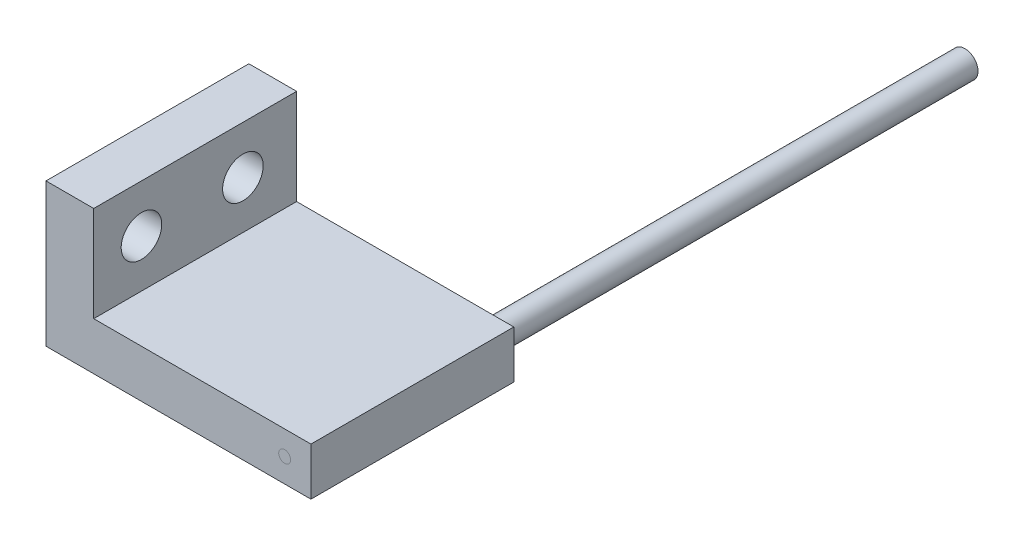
ISO-10303-21;
HEADER;
FILE_DESCRIPTION(('STEP AP214'),'2;1');
FILE_NAME('part.step','',(''),(''),'','','');
FILE_SCHEMA(('AUTOMOTIVE_DESIGN { 1 0 10303 214 1 1 1 1 }'));
ENDSEC;
DATA;
#1=APPLICATION_CONTEXT('core data for automotive mechanical design processes');
#2=APPLICATION_PROTOCOL_DEFINITION('international standard','automotive_design',2000,#1);
#3=PRODUCT_CONTEXT('',#1,'mechanical');
#4=PRODUCT('Part','Part','',(#3));
#5=PRODUCT_RELATED_PRODUCT_CATEGORY('part','',(#4));
#6=PRODUCT_DEFINITION_FORMATION('','',#4);
#7=PRODUCT_DEFINITION_CONTEXT('part definition',#1,'design');
#8=PRODUCT_DEFINITION('design','',#6,#7);
#9=PRODUCT_DEFINITION_SHAPE('','',#8);
#10=(LENGTH_UNIT() NAMED_UNIT(*) SI_UNIT(.MILLI.,.METRE.));
#11=(NAMED_UNIT(*) PLANE_ANGLE_UNIT() SI_UNIT($,.RADIAN.));
#12=(NAMED_UNIT(*) SI_UNIT($,.STERADIAN.) SOLID_ANGLE_UNIT());
#13=UNCERTAINTY_MEASURE_WITH_UNIT(LENGTH_MEASURE(1.E-05),#10,'distance_accuracy_value','');
#14=(GEOMETRIC_REPRESENTATION_CONTEXT(3) GLOBAL_UNCERTAINTY_ASSIGNED_CONTEXT((#13)) GLOBAL_UNIT_ASSIGNED_CONTEXT((#10,
#11,#12)) REPRESENTATION_CONTEXT('',''));
#15=CARTESIAN_POINT('',(0.,0.,0.));
#16=DIRECTION('',(0.,0.,1.));
#17=DIRECTION('',(1.,0.,0.));
#18=AXIS2_PLACEMENT_3D('',#15,#16,#17);
#19=CARTESIAN_POINT('',(0.,0.,17.));
#20=DIRECTION('',(0.,0.,-1.));
#21=DIRECTION('',(-1.,0.,0.));
#22=AXIS2_PLACEMENT_3D('',#19,#20,#21);
#23=PLANE('',#22);
#24=DIRECTION('',(1.,0.,0.));
#25=VECTOR('',#24,1.);
#26=CARTESIAN_POINT('',(22.2,0.,17.));
#27=LINE('',#26,#25);
#28=CARTESIAN_POINT('',(0.,0.,17.));
#29=VERTEX_POINT('',#28);
#30=CARTESIAN_POINT('',(22.2,0.,17.));
#31=VERTEX_POINT('',#30);
#32=EDGE_CURVE('E111',#29,#31,#27,.T.);
#33=ORIENTED_EDGE('',*,*,#32,.T.);
#34=DIRECTION('',(0.,1.,0.));
#35=VECTOR('',#34,1.);
#36=CARTESIAN_POINT('',(22.2,4.,17.));
#37=LINE('',#36,#35);
#38=CARTESIAN_POINT('',(22.2,4.,17.));
#39=VERTEX_POINT('',#38);
#40=EDGE_CURVE('E69',#31,#39,#37,.T.);
#41=ORIENTED_EDGE('',*,*,#40,.T.);
#42=DIRECTION('',(-1.,0.,0.));
#43=VECTOR('',#42,1.);
#44=CARTESIAN_POINT('',(4.,4.,17.));
#45=LINE('',#44,#43);
#46=CARTESIAN_POINT('',(4.,4.,17.));
#47=VERTEX_POINT('',#46);
#48=EDGE_CURVE('E82',#39,#47,#45,.T.);
#49=ORIENTED_EDGE('',*,*,#48,.T.);
#50=DIRECTION('',(0.,1.,0.));
#51=VECTOR('',#50,1.);
#52=CARTESIAN_POINT('',(4.,12.,17.));
#53=LINE('',#52,#51);
#54=CARTESIAN_POINT('',(4.,12.,17.));
#55=VERTEX_POINT('',#54);
#56=EDGE_CURVE('E76',#47,#55,#53,.T.);
#57=ORIENTED_EDGE('',*,*,#56,.T.);
#58=DIRECTION('',(-1.,0.,0.));
#59=VECTOR('',#58,1.);
#60=CARTESIAN_POINT('',(0.,12.,17.));
#61=LINE('',#60,#59);
#62=CARTESIAN_POINT('',(0.,12.,17.));
#63=VERTEX_POINT('',#62);
#64=EDGE_CURVE('E80',#55,#63,#61,.T.);
#65=ORIENTED_EDGE('',*,*,#64,.T.);
#66=DIRECTION('',(0.,-1.,0.));
#67=VECTOR('',#66,1.);
#68=CARTESIAN_POINT('',(0.,0.,17.));
#69=LINE('',#68,#67);
#70=EDGE_CURVE('E31',#63,#29,#69,.T.);
#71=ORIENTED_EDGE('',*,*,#70,.T.);
#72=EDGE_LOOP('',(#33,#41,#49,#57,#65,#71));
#73=FACE_BOUND('',#72,.T.);
#74=CARTESIAN_POINT('',(20.,2.,17.));
#75=DIRECTION('',(0.,0.,-1.));
#76=DIRECTION('',(-1.,0.,0.));
#77=AXIS2_PLACEMENT_3D('',#74,#75,#76);
#78=CIRCLE('',#77,0.5);
#79=CARTESIAN_POINT('',(19.5,2.,17.));
#80=VERTEX_POINT('',#79);
#81=EDGE_CURVE('E9',#80,#80,#78,.F.);
#82=ORIENTED_EDGE('',*,*,#81,.F.);
#83=EDGE_LOOP('',(#82));
#84=FACE_BOUND('',#83,.T.);
#85=ADVANCED_FACE('F14',(#73,#84),#23,.F.);
#86=CARTESIAN_POINT('',(20.,2.,-40.));
#87=DIRECTION('',(0.,0.,-1.));
#88=DIRECTION('',(-1.,0.,0.));
#89=AXIS2_PLACEMENT_3D('',#86,#87,#88);
#90=PLANE('',#89);
#91=CARTESIAN_POINT('',(20.,2.,-40.));
#92=DIRECTION('',(0.,0.,-1.));
#93=DIRECTION('',(-1.,0.,0.));
#94=AXIS2_PLACEMENT_3D('',#91,#92,#93);
#95=CIRCLE('',#94,1.1);
#96=CARTESIAN_POINT('',(18.9,2.,-40.));
#97=VERTEX_POINT('',#96);
#98=EDGE_CURVE('E194',#97,#97,#95,.T.);
#99=ORIENTED_EDGE('',*,*,#98,.T.);
#100=EDGE_LOOP('',(#99));
#101=FACE_BOUND('',#100,.T.);
#102=CARTESIAN_POINT('',(20.,2.,-40.));
#103=DIRECTION('',(0.,0.,-1.));
#104=DIRECTION('',(-1.,0.,0.));
#105=AXIS2_PLACEMENT_3D('',#102,#103,#104);
#106=CIRCLE('',#105,0.5);
#107=CARTESIAN_POINT('',(19.5,2.,-40.));
#108=VERTEX_POINT('',#107);
#109=EDGE_CURVE('E23',#108,#108,#106,.F.);
#110=ORIENTED_EDGE('',*,*,#109,.T.);
#111=EDGE_LOOP('',(#110));
#112=FACE_BOUND('',#111,.T.);
#113=ADVANCED_FACE('F122',(#101,#112),#90,.T.);
#114=CARTESIAN_POINT('',(22.2,0.,17.));
#115=DIRECTION('',(0.,1.,0.));
#116=DIRECTION('',(-1.,0.,0.));
#117=AXIS2_PLACEMENT_3D('',#114,#115,#116);
#118=PLANE('',#117);
#119=DIRECTION('',(1.,0.,0.));
#120=VECTOR('',#119,1.);
#121=CARTESIAN_POINT('',(22.2,0.,0.));
#122=LINE('',#121,#120);
#123=CARTESIAN_POINT('',(0.,0.,0.));
#124=VERTEX_POINT('',#123);
#125=CARTESIAN_POINT('',(22.2,0.,0.));
#126=VERTEX_POINT('',#125);
#127=EDGE_CURVE('E100',#124,#126,#122,.T.);
#128=ORIENTED_EDGE('',*,*,#127,.T.);
#129=DIRECTION('',(0.,0.,-1.));
#130=VECTOR('',#129,1.);
#131=CARTESIAN_POINT('',(22.2,0.,17.));
#132=LINE('',#131,#130);
#133=EDGE_CURVE('E118',#31,#126,#132,.T.);
#134=ORIENTED_EDGE('',*,*,#133,.F.);
#135=ORIENTED_EDGE('',*,*,#32,.F.);
#136=DIRECTION('',(0.,0.,-1.));
#137=VECTOR('',#136,1.);
#138=CARTESIAN_POINT('',(0.,0.,17.));
#139=LINE('',#138,#137);
#140=EDGE_CURVE('E96',#29,#124,#139,.T.);
#141=ORIENTED_EDGE('',*,*,#140,.T.);
#142=EDGE_LOOP('',(#128,#134,#135,#141));
#143=FACE_BOUND('',#142,.T.);
#144=ADVANCED_FACE('F16',(#143),#118,.F.);
#145=CARTESIAN_POINT('',(22.2,4.,17.));
#146=DIRECTION('',(-1.,0.,0.));
#147=DIRECTION('',(0.,0.,1.));
#148=AXIS2_PLACEMENT_3D('',#145,#146,#147);
#149=PLANE('',#148);
#150=DIRECTION('',(0.,1.,0.));
#151=VECTOR('',#150,1.);
#152=CARTESIAN_POINT('',(22.2,4.,0.));
#153=LINE('',#152,#151);
#154=CARTESIAN_POINT('',(22.2,4.,0.));
#155=VERTEX_POINT('',#154);
#156=EDGE_CURVE('E103',#126,#155,#153,.T.);
#157=ORIENTED_EDGE('',*,*,#156,.T.);
#158=DIRECTION('',(0.,0.,-1.));
#159=VECTOR('',#158,1.);
#160=CARTESIAN_POINT('',(22.2,4.,17.));
#161=LINE('',#160,#159);
#162=EDGE_CURVE('E115',#39,#155,#161,.T.);
#163=ORIENTED_EDGE('',*,*,#162,.F.);
#164=ORIENTED_EDGE('',*,*,#40,.F.);
#165=ORIENTED_EDGE('',*,*,#133,.T.);
#166=EDGE_LOOP('',(#157,#163,#164,#165));
#167=FACE_BOUND('',#166,.T.);
#168=ADVANCED_FACE('F172',(#167),#149,.F.);
#169=CARTESIAN_POINT('',(4.,4.,17.));
#170=DIRECTION('',(0.,-1.,0.));
#171=DIRECTION('',(1.,0.,0.));
#172=AXIS2_PLACEMENT_3D('',#169,#170,#171);
#173=PLANE('',#172);
#174=DIRECTION('',(-1.,0.,0.));
#175=VECTOR('',#174,1.);
#176=CARTESIAN_POINT('',(4.,4.,0.));
#177=LINE('',#176,#175);
#178=CARTESIAN_POINT('',(4.,4.,0.));
#179=VERTEX_POINT('',#178);
#180=EDGE_CURVE('E106',#155,#179,#177,.T.);
#181=ORIENTED_EDGE('',*,*,#180,.T.);
#182=DIRECTION('',(0.,0.,-1.));
#183=VECTOR('',#182,1.);
#184=CARTESIAN_POINT('',(4.,4.,17.));
#185=LINE('',#184,#183);
#186=EDGE_CURVE('E91',#47,#179,#185,.T.);
#187=ORIENTED_EDGE('',*,*,#186,.F.);
#188=ORIENTED_EDGE('',*,*,#48,.F.);
#189=ORIENTED_EDGE('',*,*,#162,.T.);
#190=EDGE_LOOP('',(#181,#187,#188,#189));
#191=FACE_BOUND('',#190,.T.);
#192=ADVANCED_FACE('F170',(#191),#173,.F.);
#193=CARTESIAN_POINT('',(4.,12.,17.));
#194=DIRECTION('',(-1.,0.,0.));
#195=DIRECTION('',(0.,-1.,0.));
#196=AXIS2_PLACEMENT_3D('',#193,#194,#195);
#197=PLANE('',#196);
#198=CARTESIAN_POINT('',(4.,8.,4.5));
#199=DIRECTION('',(1.,0.,0.));
#200=DIRECTION('',(0.,1.,0.));
#201=AXIS2_PLACEMENT_3D('',#198,#199,#200);
#202=CIRCLE('',#201,1.7);
#203=CARTESIAN_POINT('',(4.,9.7,4.5));
#204=VERTEX_POINT('',#203);
#205=EDGE_CURVE('E191',#204,#204,#202,.T.);
#206=ORIENTED_EDGE('',*,*,#205,.F.);
#207=EDGE_LOOP('',(#206));
#208=FACE_BOUND('',#207,.T.);
#209=CARTESIAN_POINT('',(4.,8.,13.));
#210=DIRECTION('',(1.,0.,0.));
#211=DIRECTION('',(0.,1.,0.));
#212=AXIS2_PLACEMENT_3D('',#209,#210,#211);
#213=CIRCLE('',#212,1.7);
#214=CARTESIAN_POINT('',(4.,9.7,13.));
#215=VERTEX_POINT('',#214);
#216=EDGE_CURVE('E185',#215,#215,#213,.T.);
#217=ORIENTED_EDGE('',*,*,#216,.F.);
#218=EDGE_LOOP('',(#217));
#219=FACE_BOUND('',#218,.T.);
#220=DIRECTION('',(0.,1.,0.));
#221=VECTOR('',#220,1.);
#222=CARTESIAN_POINT('',(4.,12.,0.));
#223=LINE('',#222,#221);
#224=CARTESIAN_POINT('',(4.,12.,0.));
#225=VERTEX_POINT('',#224);
#226=EDGE_CURVE('E90',#179,#225,#223,.T.);
#227=ORIENTED_EDGE('',*,*,#226,.T.);
#228=DIRECTION('',(0.,0.,-1.));
#229=VECTOR('',#228,1.);
#230=CARTESIAN_POINT('',(4.,12.,17.));
#231=LINE('',#230,#229);
#232=EDGE_CURVE('E87',#55,#225,#231,.T.);
#233=ORIENTED_EDGE('',*,*,#232,.F.);
#234=ORIENTED_EDGE('',*,*,#56,.F.);
#235=ORIENTED_EDGE('',*,*,#186,.T.);
#236=EDGE_LOOP('',(#227,#233,#234,#235));
#237=FACE_BOUND('',#236,.T.);
#238=ADVANCED_FACE('F88',(#208,#219,#237),#197,.F.);
#239=CARTESIAN_POINT('',(0.,12.,17.));
#240=DIRECTION('',(0.,-1.,0.));
#241=DIRECTION('',(0.,0.,-1.));
#242=AXIS2_PLACEMENT_3D('',#239,#240,#241);
#243=PLANE('',#242);
#244=DIRECTION('',(-1.,0.,0.));
#245=VECTOR('',#244,1.);
#246=CARTESIAN_POINT('',(0.,12.,0.));
#247=LINE('',#246,#245);
#248=CARTESIAN_POINT('',(0.,12.,0.));
#249=VERTEX_POINT('',#248);
#250=EDGE_CURVE('E54',#225,#249,#247,.T.);
#251=ORIENTED_EDGE('',*,*,#250,.T.);
#252=DIRECTION('',(0.,0.,-1.));
#253=VECTOR('',#252,1.);
#254=CARTESIAN_POINT('',(0.,12.,17.));
#255=LINE('',#254,#253);
#256=EDGE_CURVE('E92',#63,#249,#255,.T.);
#257=ORIENTED_EDGE('',*,*,#256,.F.);
#258=ORIENTED_EDGE('',*,*,#64,.F.);
#259=ORIENTED_EDGE('',*,*,#232,.T.);
#260=EDGE_LOOP('',(#251,#257,#258,#259));
#261=FACE_BOUND('',#260,.T.);
#262=ADVANCED_FACE('F94',(#261),#243,.F.);
#263=CARTESIAN_POINT('',(0.,0.,17.));
#264=DIRECTION('',(1.,0.,0.));
#265=DIRECTION('',(0.,0.,-1.));
#266=AXIS2_PLACEMENT_3D('',#263,#264,#265);
#267=PLANE('',#266);
#268=CARTESIAN_POINT('',(0.,8.,4.5));
#269=DIRECTION('',(1.,0.,0.));
#270=DIRECTION('',(0.,1.,0.));
#271=AXIS2_PLACEMENT_3D('',#268,#269,#270);
#272=CIRCLE('',#271,1.7);
#273=CARTESIAN_POINT('',(0.,9.7,4.5));
#274=VERTEX_POINT('',#273);
#275=EDGE_CURVE('E188',#274,#274,#272,.T.);
#276=ORIENTED_EDGE('',*,*,#275,.T.);
#277=EDGE_LOOP('',(#276));
#278=FACE_BOUND('',#277,.T.);
#279=CARTESIAN_POINT('',(0.,8.,13.));
#280=DIRECTION('',(1.,0.,0.));
#281=DIRECTION('',(0.,1.,0.));
#282=AXIS2_PLACEMENT_3D('',#279,#280,#281);
#283=CIRCLE('',#282,1.7);
#284=CARTESIAN_POINT('',(0.,9.7,13.));
#285=VERTEX_POINT('',#284);
#286=EDGE_CURVE('E104',#285,#285,#283,.T.);
#287=ORIENTED_EDGE('',*,*,#286,.T.);
#288=EDGE_LOOP('',(#287));
#289=FACE_BOUND('',#288,.T.);
#290=DIRECTION('',(0.,-1.,0.));
#291=VECTOR('',#290,1.);
#292=CARTESIAN_POINT('',(0.,0.,0.));
#293=LINE('',#292,#291);
#294=EDGE_CURVE('E60',#249,#124,#293,.T.);
#295=ORIENTED_EDGE('',*,*,#294,.T.);
#296=ORIENTED_EDGE('',*,*,#140,.F.);
#297=ORIENTED_EDGE('',*,*,#70,.F.);
#298=ORIENTED_EDGE('',*,*,#256,.T.);
#299=EDGE_LOOP('',(#295,#296,#297,#298));
#300=FACE_BOUND('',#299,.T.);
#301=ADVANCED_FACE('F148',(#278,#289,#300),#267,.F.);
#302=ORIENTED_EDGE('',*,*,#81,.T.);
#303=EDGE_LOOP('',(#302));
#304=FACE_BOUND('',#303,.T.);
#305=ADVANCED_FACE('F140',(#304),#23,.F.);
#306=CARTESIAN_POINT('',(0.,0.,0.));
#307=DIRECTION('',(0.,0.,-1.));
#308=DIRECTION('',(-1.,0.,0.));
#309=AXIS2_PLACEMENT_3D('',#306,#307,#308);
#310=PLANE('',#309);
#311=CARTESIAN_POINT('',(20.,2.,0.));
#312=DIRECTION('',(0.,0.,-1.));
#313=DIRECTION('',(-1.,0.,0.));
#314=AXIS2_PLACEMENT_3D('',#311,#312,#313);
#315=CIRCLE('',#314,1.1);
#316=CARTESIAN_POINT('',(18.9,2.,0.));
#317=VERTEX_POINT('',#316);
#318=EDGE_CURVE('E196',#317,#317,#315,.T.);
#319=ORIENTED_EDGE('',*,*,#318,.F.);
#320=EDGE_LOOP('',(#319));
#321=FACE_BOUND('',#320,.T.);
#322=ORIENTED_EDGE('',*,*,#127,.F.);
#323=ORIENTED_EDGE('',*,*,#294,.F.);
#324=ORIENTED_EDGE('',*,*,#250,.F.);
#325=ORIENTED_EDGE('',*,*,#226,.F.);
#326=ORIENTED_EDGE('',*,*,#180,.F.);
#327=ORIENTED_EDGE('',*,*,#156,.F.);
#328=EDGE_LOOP('',(#322,#323,#324,#325,#326,#327));
#329=FACE_BOUND('',#328,.T.);
#330=ADVANCED_FACE('F147',(#321,#329),#310,.T.);
#331=CARTESIAN_POINT('',(0.,8.,13.));
#332=DIRECTION('',(1.,0.,0.));
#333=DIRECTION('',(0.,1.,0.));
#334=AXIS2_PLACEMENT_3D('',#331,#332,#333);
#335=CYLINDRICAL_SURFACE('',#334,1.7);
#336=ORIENTED_EDGE('',*,*,#286,.F.);
#337=EDGE_LOOP('',(#336));
#338=FACE_BOUND('',#337,.T.);
#339=ORIENTED_EDGE('',*,*,#216,.T.);
#340=EDGE_LOOP('',(#339));
#341=FACE_BOUND('',#340,.T.);
#342=ADVANCED_FACE('F154',(#338,#341),#335,.F.);
#343=CARTESIAN_POINT('',(0.,8.,4.5));
#344=DIRECTION('',(1.,0.,0.));
#345=DIRECTION('',(0.,1.,0.));
#346=AXIS2_PLACEMENT_3D('',#343,#344,#345);
#347=CYLINDRICAL_SURFACE('',#346,1.7);
#348=ORIENTED_EDGE('',*,*,#275,.F.);
#349=EDGE_LOOP('',(#348));
#350=FACE_BOUND('',#349,.T.);
#351=ORIENTED_EDGE('',*,*,#205,.T.);
#352=EDGE_LOOP('',(#351));
#353=FACE_BOUND('',#352,.T.);
#354=ADVANCED_FACE('F133',(#350,#353),#347,.F.);
#355=CARTESIAN_POINT('',(20.,2.,-40.));
#356=DIRECTION('',(0.,0.,1.));
#357=DIRECTION('',(1.,0.,0.));
#358=AXIS2_PLACEMENT_3D('',#355,#356,#357);
#359=CYLINDRICAL_SURFACE('',#358,1.1);
#360=ORIENTED_EDGE('',*,*,#98,.F.);
#361=EDGE_LOOP('',(#360));
#362=FACE_BOUND('',#361,.T.);
#363=ORIENTED_EDGE('',*,*,#318,.T.);
#364=EDGE_LOOP('',(#363));
#365=FACE_BOUND('',#364,.T.);
#366=ADVANCED_FACE('F126',(#362,#365),#359,.T.);
#367=ORIENTED_EDGE('',*,*,#109,.F.);
#368=EDGE_LOOP('',(#367));
#369=FACE_BOUND('',#368,.T.);
#370=ADVANCED_FACE('F124',(#369),#90,.T.);
#371=CLOSED_SHELL('',(#85,#113,#144,#168,#192,#238,#262,#301,#305,#330,#342,#354,#366,#370));
#372=MANIFOLD_SOLID_BREP('B1',#371);
#373=ADVANCED_BREP_SHAPE_REPRESENTATION('',(#18,#372),#14);
#374=SHAPE_DEFINITION_REPRESENTATION(#9,#373);
ENDSEC;
END-ISO-10303-21;
